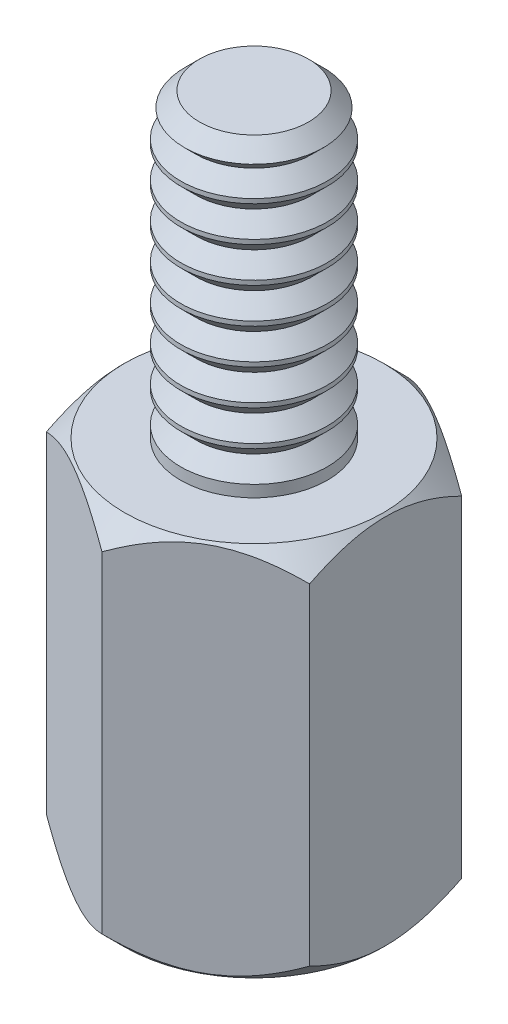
ISO-10303-21;
HEADER;
FILE_DESCRIPTION(('STEP AP214'),'2;1');
FILE_NAME('part.step','',(''),(''),'','','');
FILE_SCHEMA(('AUTOMOTIVE_DESIGN { 1 0 10303 214 1 1 1 1 }'));
ENDSEC;
DATA;
#1=APPLICATION_CONTEXT('core data for automotive mechanical design processes');
#2=APPLICATION_PROTOCOL_DEFINITION('international standard','automotive_design',2000,#1);
#3=PRODUCT_CONTEXT('',#1,'mechanical');
#4=PRODUCT('Part','Part','',(#3));
#5=PRODUCT_RELATED_PRODUCT_CATEGORY('part','',(#4));
#6=PRODUCT_DEFINITION_FORMATION('','',#4);
#7=PRODUCT_DEFINITION_CONTEXT('part definition',#1,'design');
#8=PRODUCT_DEFINITION('design','',#6,#7);
#9=PRODUCT_DEFINITION_SHAPE('','',#8);
#10=(LENGTH_UNIT() NAMED_UNIT(*) SI_UNIT(.MILLI.,.METRE.));
#11=(NAMED_UNIT(*) PLANE_ANGLE_UNIT() SI_UNIT($,.RADIAN.));
#12=(NAMED_UNIT(*) SI_UNIT($,.STERADIAN.) SOLID_ANGLE_UNIT());
#13=UNCERTAINTY_MEASURE_WITH_UNIT(LENGTH_MEASURE(1.E-05),#10,'distance_accuracy_value','');
#14=(GEOMETRIC_REPRESENTATION_CONTEXT(3) GLOBAL_UNCERTAINTY_ASSIGNED_CONTEXT((#13)) GLOBAL_UNIT_ASSIGNED_CONTEXT((#10,
#11,#12)) REPRESENTATION_CONTEXT('',''));
#15=CARTESIAN_POINT('',(0.,0.,0.));
#16=DIRECTION('',(0.,0.,1.));
#17=DIRECTION('',(1.,0.,0.));
#18=AXIS2_PLACEMENT_3D('',#15,#16,#17);
#19=CARTESIAN_POINT('',(0.,18.,0.));
#20=DIRECTION('',(0.,-1.,0.));
#21=DIRECTION('',(0.,0.,-1.));
#22=AXIS2_PLACEMENT_3D('',#19,#20,#21);
#23=CYLINDRICAL_SURFACE('',#22,1.95);
#24=CARTESIAN_POINT('',(0.,13.9502438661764,0.));
#25=DIRECTION('',(0.,-1.,0.));
#26=DIRECTION('',(0.,0.,-1.));
#27=AXIS2_PLACEMENT_3D('',#24,#25,#26);
#28=CIRCLE('',#27,1.95);
#29=CARTESIAN_POINT('',(0.,13.9502438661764,-1.95));
#30=VERTEX_POINT('',#29);
#31=EDGE_CURVE('E320',#30,#30,#28,.T.);
#32=ORIENTED_EDGE('',*,*,#31,.F.);
#33=EDGE_LOOP('',(#32));
#34=FACE_BOUND('',#33,.T.);
#35=CARTESIAN_POINT('',(0.,14.07,0.));
#36=DIRECTION('',(0.,-1.,0.));
#37=DIRECTION('',(0.,0.,-1.));
#38=AXIS2_PLACEMENT_3D('',#35,#36,#37);
#39=CIRCLE('',#38,1.95);
#40=CARTESIAN_POINT('',(0.,14.07,-1.95));
#41=VERTEX_POINT('',#40);
#42=EDGE_CURVE('E635',#41,#41,#39,.T.);
#43=ORIENTED_EDGE('',*,*,#42,.T.);
#44=EDGE_LOOP('',(#43));
#45=FACE_BOUND('',#44,.T.);
#46=ADVANCED_FACE('F34',(#34,#45),#23,.T.);
#47=CARTESIAN_POINT('',(0.,11.25,0.));
#48=DIRECTION('',(0.,-1.,0.));
#49=DIRECTION('',(0.,0.,-1.));
#50=AXIS2_PLACEMENT_3D('',#47,#48,#49);
#51=CIRCLE('',#50,1.95);
#52=CARTESIAN_POINT('',(0.,11.25,-1.95));
#53=VERTEX_POINT('',#52);
#54=EDGE_CURVE('E314',#53,#53,#51,.T.);
#55=ORIENTED_EDGE('',*,*,#54,.T.);
#56=EDGE_LOOP('',(#55));
#57=FACE_BOUND('',#56,.T.);
#58=CARTESIAN_POINT('',(0.,11.1302438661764,0.));
#59=DIRECTION('',(0.,-1.,0.));
#60=DIRECTION('',(0.,0.,-1.));
#61=AXIS2_PLACEMENT_3D('',#58,#59,#60);
#62=CIRCLE('',#61,1.95);
#63=CARTESIAN_POINT('',(0.,11.1302438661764,-1.95));
#64=VERTEX_POINT('',#63);
#65=EDGE_CURVE('E363',#64,#64,#62,.T.);
#66=ORIENTED_EDGE('',*,*,#65,.F.);
#67=EDGE_LOOP('',(#66));
#68=FACE_BOUND('',#67,.T.);
#69=ADVANCED_FACE('F240',(#57,#68),#23,.T.);
#70=CARTESIAN_POINT('',(0.,12.19,0.));
#71=DIRECTION('',(0.,-1.,0.));
#72=DIRECTION('',(0.,0.,-1.));
#73=AXIS2_PLACEMENT_3D('',#70,#71,#72);
#74=CIRCLE('',#73,1.95);
#75=CARTESIAN_POINT('',(0.,12.19,-1.95));
#76=VERTEX_POINT('',#75);
#77=EDGE_CURVE('E307',#76,#76,#74,.T.);
#78=ORIENTED_EDGE('',*,*,#77,.T.);
#79=EDGE_LOOP('',(#78));
#80=FACE_BOUND('',#79,.T.);
#81=CARTESIAN_POINT('',(0.,12.0702438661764,0.));
#82=DIRECTION('',(0.,-1.,0.));
#83=DIRECTION('',(0.,0.,-1.));
#84=AXIS2_PLACEMENT_3D('',#81,#82,#83);
#85=CIRCLE('',#84,1.95);
#86=CARTESIAN_POINT('',(0.,12.0702438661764,-1.95));
#87=VERTEX_POINT('',#86);
#88=EDGE_CURVE('E366',#87,#87,#85,.T.);
#89=ORIENTED_EDGE('',*,*,#88,.F.);
#90=EDGE_LOOP('',(#89));
#91=FACE_BOUND('',#90,.T.);
#92=ADVANCED_FACE('F239',(#80,#91),#23,.T.);
#93=CARTESIAN_POINT('',(0.,13.13,0.));
#94=DIRECTION('',(0.,-1.,0.));
#95=DIRECTION('',(0.,0.,-1.));
#96=AXIS2_PLACEMENT_3D('',#93,#94,#95);
#97=CIRCLE('',#96,1.95);
#98=CARTESIAN_POINT('',(0.,13.13,-1.95));
#99=VERTEX_POINT('',#98);
#100=EDGE_CURVE('E302',#99,#99,#97,.T.);
#101=ORIENTED_EDGE('',*,*,#100,.T.);
#102=EDGE_LOOP('',(#101));
#103=FACE_BOUND('',#102,.T.);
#104=CARTESIAN_POINT('',(0.,13.0102438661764,0.));
#105=DIRECTION('',(0.,-1.,0.));
#106=DIRECTION('',(0.,0.,-1.));
#107=AXIS2_PLACEMENT_3D('',#104,#105,#106);
#108=CIRCLE('',#107,1.95);
#109=CARTESIAN_POINT('',(0.,13.0102438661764,-1.95));
#110=VERTEX_POINT('',#109);
#111=EDGE_CURVE('E305',#110,#110,#108,.T.);
#112=ORIENTED_EDGE('',*,*,#111,.F.);
#113=EDGE_LOOP('',(#112));
#114=FACE_BOUND('',#113,.T.);
#115=ADVANCED_FACE('F277',(#103,#114),#23,.T.);
#116=CARTESIAN_POINT('',(0.,13.5401219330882,0.));
#117=DIRECTION('',(0.,1.,0.));
#118=DIRECTION('',(0.,0.,1.));
#119=AXIS2_PLACEMENT_3D('',#116,#117,#118);
#120=CONICAL_SURFACE('',#119,1.5398780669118,0.785398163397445);
#121=ORIENTED_EDGE('',*,*,#31,.T.);
#122=EDGE_LOOP('',(#121));
#123=FACE_BOUND('',#122,.T.);
#124=CARTESIAN_POINT('',(0.,13.5401219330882,0.));
#125=DIRECTION('',(0.,-1.,0.));
#126=DIRECTION('',(0.,0.,-1.));
#127=AXIS2_PLACEMENT_3D('',#124,#125,#126);
#128=CIRCLE('',#127,1.5398780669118);
#129=CARTESIAN_POINT('',(0.,13.5401219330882,-1.5398780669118));
#130=VERTEX_POINT('',#129);
#131=EDGE_CURVE('E324',#130,#130,#128,.T.);
#132=ORIENTED_EDGE('',*,*,#131,.F.);
#133=EDGE_LOOP('',(#132));
#134=FACE_BOUND('',#133,.T.);
#135=ADVANCED_FACE('F289',(#123,#134),#120,.T.);
#136=CARTESIAN_POINT('',(0.,13.13,0.));
#137=DIRECTION('',(0.,-1.,0.));
#138=DIRECTION('',(0.,0.,-1.));
#139=AXIS2_PLACEMENT_3D('',#136,#137,#138);
#140=CONICAL_SURFACE('',#139,1.95,0.785398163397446);
#141=ORIENTED_EDGE('',*,*,#131,.T.);
#142=EDGE_LOOP('',(#141));
#143=FACE_BOUND('',#142,.T.);
#144=ORIENTED_EDGE('',*,*,#100,.F.);
#145=EDGE_LOOP('',(#144));
#146=FACE_BOUND('',#145,.T.);
#147=ADVANCED_FACE('F295',(#143,#146),#140,.T.);
#148=CARTESIAN_POINT('',(0.,12.6001219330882,0.));
#149=DIRECTION('',(0.,1.,0.));
#150=DIRECTION('',(0.,0.,1.));
#151=AXIS2_PLACEMENT_3D('',#148,#149,#150);
#152=CONICAL_SURFACE('',#151,1.5398780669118,0.785398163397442);
#153=ORIENTED_EDGE('',*,*,#111,.T.);
#154=EDGE_LOOP('',(#153));
#155=FACE_BOUND('',#154,.T.);
#156=CARTESIAN_POINT('',(0.,12.6001219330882,0.));
#157=DIRECTION('',(0.,-1.,0.));
#158=DIRECTION('',(0.,0.,-1.));
#159=AXIS2_PLACEMENT_3D('',#156,#157,#158);
#160=CIRCLE('',#159,1.5398780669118);
#161=CARTESIAN_POINT('',(0.,12.6001219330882,-1.5398780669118));
#162=VERTEX_POINT('',#161);
#163=EDGE_CURVE('E311',#162,#162,#160,.T.);
#164=ORIENTED_EDGE('',*,*,#163,.F.);
#165=EDGE_LOOP('',(#164));
#166=FACE_BOUND('',#165,.T.);
#167=ADVANCED_FACE('F395',(#155,#166),#152,.T.);
#168=CARTESIAN_POINT('',(0.,12.19,0.));
#169=DIRECTION('',(0.,-1.,0.));
#170=DIRECTION('',(0.,0.,-1.));
#171=AXIS2_PLACEMENT_3D('',#168,#169,#170);
#172=CONICAL_SURFACE('',#171,1.95,0.785398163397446);
#173=ORIENTED_EDGE('',*,*,#163,.T.);
#174=EDGE_LOOP('',(#173));
#175=FACE_BOUND('',#174,.T.);
#176=ORIENTED_EDGE('',*,*,#77,.F.);
#177=EDGE_LOOP('',(#176));
#178=FACE_BOUND('',#177,.T.);
#179=ADVANCED_FACE('F390',(#175,#178),#172,.T.);
#180=CARTESIAN_POINT('',(0.,11.6601219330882,0.));
#181=DIRECTION('',(0.,1.,0.));
#182=DIRECTION('',(0.,0.,1.));
#183=AXIS2_PLACEMENT_3D('',#180,#181,#182);
#184=CONICAL_SURFACE('',#183,1.5398780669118,0.785398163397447);
#185=ORIENTED_EDGE('',*,*,#88,.T.);
#186=EDGE_LOOP('',(#185));
#187=FACE_BOUND('',#186,.T.);
#188=CARTESIAN_POINT('',(0.,11.6601219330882,0.));
#189=DIRECTION('',(0.,-1.,0.));
#190=DIRECTION('',(0.,0.,-1.));
#191=AXIS2_PLACEMENT_3D('',#188,#189,#190);
#192=CIRCLE('',#191,1.5398780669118);
#193=CARTESIAN_POINT('',(0.,11.6601219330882,-1.5398780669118));
#194=VERTEX_POINT('',#193);
#195=EDGE_CURVE('E308',#194,#194,#192,.T.);
#196=ORIENTED_EDGE('',*,*,#195,.F.);
#197=EDGE_LOOP('',(#196));
#198=FACE_BOUND('',#197,.T.);
#199=ADVANCED_FACE('F381',(#187,#198),#184,.T.);
#200=CARTESIAN_POINT('',(0.,11.25,0.));
#201=DIRECTION('',(0.,-1.,0.));
#202=DIRECTION('',(0.,0.,-1.));
#203=AXIS2_PLACEMENT_3D('',#200,#201,#202);
#204=CONICAL_SURFACE('',#203,1.95,0.785398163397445);
#205=ORIENTED_EDGE('',*,*,#195,.T.);
#206=EDGE_LOOP('',(#205));
#207=FACE_BOUND('',#206,.T.);
#208=ORIENTED_EDGE('',*,*,#54,.F.);
#209=EDGE_LOOP('',(#208));
#210=FACE_BOUND('',#209,.T.);
#211=ADVANCED_FACE('F378',(#207,#210),#204,.T.);
#212=CARTESIAN_POINT('',(0.,10.7201219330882,0.));
#213=DIRECTION('',(0.,1.,0.));
#214=DIRECTION('',(0.,0.,1.));
#215=AXIS2_PLACEMENT_3D('',#212,#213,#214);
#216=CONICAL_SURFACE('',#215,1.5398780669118,0.785398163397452);
#217=ORIENTED_EDGE('',*,*,#65,.T.);
#218=EDGE_LOOP('',(#217));
#219=FACE_BOUND('',#218,.T.);
#220=CARTESIAN_POINT('',(0.,10.7201219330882,0.));
#221=DIRECTION('',(0.,-1.,0.));
#222=DIRECTION('',(0.,0.,-1.));
#223=AXIS2_PLACEMENT_3D('',#220,#221,#222);
#224=CIRCLE('',#223,1.5398780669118);
#225=CARTESIAN_POINT('',(0.,10.7201219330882,-1.5398780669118));
#226=VERTEX_POINT('',#225);
#227=EDGE_CURVE('E362',#226,#226,#224,.T.);
#228=ORIENTED_EDGE('',*,*,#227,.F.);
#229=EDGE_LOOP('',(#228));
#230=FACE_BOUND('',#229,.T.);
#231=ADVANCED_FACE('F380',(#219,#230),#216,.T.);
#232=CARTESIAN_POINT('',(0.,10.31,0.));
#233=DIRECTION('',(0.,-1.,0.));
#234=DIRECTION('',(0.,0.,-1.));
#235=AXIS2_PLACEMENT_3D('',#232,#233,#234);
#236=CONICAL_SURFACE('',#235,1.95,0.785398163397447);
#237=ORIENTED_EDGE('',*,*,#227,.T.);
#238=EDGE_LOOP('',(#237));
#239=FACE_BOUND('',#238,.T.);
#240=CARTESIAN_POINT('',(0.,10.31,0.));
#241=DIRECTION('',(0.,-1.,0.));
#242=DIRECTION('',(0.,0.,-1.));
#243=AXIS2_PLACEMENT_3D('',#240,#241,#242);
#244=CIRCLE('',#243,1.95);
#245=CARTESIAN_POINT('',(0.,10.31,-1.95));
#246=VERTEX_POINT('',#245);
#247=EDGE_CURVE('E360',#246,#246,#244,.T.);
#248=ORIENTED_EDGE('',*,*,#247,.F.);
#249=EDGE_LOOP('',(#248));
#250=FACE_BOUND('',#249,.T.);
#251=ADVANCED_FACE('F227',(#239,#250),#236,.T.);
#252=CARTESIAN_POINT('',(0.,0.,0.));
#253=DIRECTION('',(0.,1.,0.));
#254=DIRECTION('',(0.,0.,1.));
#255=AXIS2_PLACEMENT_3D('',#252,#253,#254);
#256=PLANE('',#255);
#257=CARTESIAN_POINT('',(0.,0.,0.));
#258=DIRECTION('',(0.,-1.,0.));
#259=DIRECTION('',(0.,0.,-1.));
#260=AXIS2_PLACEMENT_3D('',#257,#258,#259);
#261=CIRCLE('',#260,1.95);
#262=CARTESIAN_POINT('',(0.,0.,-1.95));
#263=VERTEX_POINT('',#262);
#264=EDGE_CURVE('E636',#263,#263,#261,.T.);
#265=ORIENTED_EDGE('',*,*,#264,.F.);
#266=EDGE_LOOP('',(#265));
#267=FACE_BOUND('',#266,.T.);
#268=CARTESIAN_POINT('',(0.,0.,0.));
#269=DIRECTION('',(0.,1.,0.));
#270=DIRECTION('',(0.,0.,1.));
#271=AXIS2_PLACEMENT_3D('',#268,#269,#270);
#272=CIRCLE('',#271,3.44145188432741);
#273=CARTESIAN_POINT('',(0.,0.,3.44145188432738));
#274=VERTEX_POINT('',#273);
#275=EDGE_CURVE('E353',#274,#274,#272,.T.);
#276=ORIENTED_EDGE('',*,*,#275,.F.);
#277=EDGE_LOOP('',(#276));
#278=FACE_BOUND('',#277,.T.);
#279=ADVANCED_FACE('F154',(#267,#278),#256,.F.);
#280=CARTESIAN_POINT('',(0.,0.,0.));
#281=DIRECTION('',(0.,1.,0.));
#282=DIRECTION('',(0.,0.,1.));
#283=AXIS2_PLACEMENT_3D('',#280,#281,#282);
#284=CONICAL_SURFACE('',#283,3.44145188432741,0.785398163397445);
#285=ORIENTED_EDGE('',*,*,#275,.T.);
#286=EDGE_LOOP('',(#285));
#287=FACE_BOUND('',#286,.T.);
#288=CARTESIAN_POINT('',(3.5,2.02072419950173,-4.19349109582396));
#289=CARTESIAN_POINT('',(3.5,1.94289024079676,-4.09208669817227));
#290=CARTESIAN_POINT('',(3.5,1.86576032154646,-3.99013324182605));
#291=CARTESIAN_POINT('',(3.5,1.71322942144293,-3.78490475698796));
#292=CARTESIAN_POINT('',(3.5,1.63782885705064,-3.68162941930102));
#293=CARTESIAN_POINT('',(3.5,1.48854088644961,-3.47277876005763));
#294=CARTESIAN_POINT('',(3.5,1.41466965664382,-3.36719183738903));
#295=CARTESIAN_POINT('',(3.5,1.26952037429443,-3.15425614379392));
#296=CARTESIAN_POINT('',(3.5,1.19824214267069,-3.04690749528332));
#297=CARTESIAN_POINT('',(3.5,1.05450441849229,-2.8233680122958));
#298=CARTESIAN_POINT('',(3.5,0.982250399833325,-2.7070443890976));
#299=CARTESIAN_POINT('',(3.5,0.84225947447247,-2.4716670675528));
#300=CARTESIAN_POINT('',(3.5,0.774523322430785,-2.35261291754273));
#301=CARTESIAN_POINT('',(3.5,0.64501308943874,-2.11174739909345));
#302=CARTESIAN_POINT('',(3.5,0.583221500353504,-1.98994551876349));
#303=CARTESIAN_POINT('',(3.5,0.466984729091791,-1.74291320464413));
#304=CARTESIAN_POINT('',(3.5,0.412536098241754,-1.61768441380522));
#305=CARTESIAN_POINT('',(3.5,0.317760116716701,-1.37579906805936));
#306=CARTESIAN_POINT('',(3.5,0.276577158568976,-1.25948120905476));
#307=CARTESIAN_POINT('',(3.5,0.203523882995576,-1.02390221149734));
#308=CARTESIAN_POINT('',(3.5,0.171654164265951,-0.904640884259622));
#309=CARTESIAN_POINT('',(3.5,0.11947561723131,-0.665952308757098));
#310=CARTESIAN_POINT('',(3.5,0.0989583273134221,-0.546571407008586));
#311=CARTESIAN_POINT('',(3.5,0.0699092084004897,-0.306352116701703));
#312=CARTESIAN_POINT('',(3.5,0.0613749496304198,-0.185514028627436));
#313=CARTESIAN_POINT('',(3.5,0.0570073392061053,0.0512281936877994));
#314=CARTESIAN_POINT('',(3.5,0.0606472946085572,0.167122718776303));
#315=CARTESIAN_POINT('',(3.5,0.0792233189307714,0.397996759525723));
#316=CARTESIAN_POINT('',(3.5,0.0941604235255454,0.512976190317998));
#317=CARTESIAN_POINT('',(3.5,0.134743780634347,0.743135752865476));
#318=CARTESIAN_POINT('',(3.5,0.16057823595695,0.858282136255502));
#319=CARTESIAN_POINT('',(3.5,0.22153002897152,1.08604290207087));
#320=CARTESIAN_POINT('',(3.5,0.256646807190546,1.19865743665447));
#321=CARTESIAN_POINT('',(3.5,0.33704334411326,1.4280323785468));
#322=CARTESIAN_POINT('',(3.5,0.382817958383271,1.54461737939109));
#323=CARTESIAN_POINT('',(3.5,0.481428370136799,1.77477031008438));
#324=CARTESIAN_POINT('',(3.5,0.534266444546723,1.88833725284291));
#325=CARTESIAN_POINT('',(3.5,0.645758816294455,2.11301559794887));
#326=CARTESIAN_POINT('',(3.5,0.704431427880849,2.22411783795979));
#327=CARTESIAN_POINT('',(3.5,0.826298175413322,2.44377531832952));
#328=CARTESIAN_POINT('',(3.5,0.889491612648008,2.55233094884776));
#329=CARTESIAN_POINT('',(3.5,1.01630412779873,2.76191944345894));
#330=CARTESIAN_POINT('',(3.5,1.07974785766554,2.86305896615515));
#331=CARTESIAN_POINT('',(3.5,1.20933246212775,3.06360047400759));
#332=CARTESIAN_POINT('',(3.5,1.27547353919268,3.16300232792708));
#333=CARTESIAN_POINT('',(3.5,1.40943239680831,3.35949586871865));
#334=CARTESIAN_POINT('',(3.5,1.4772324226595,3.45659970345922));
#335=CARTESIAN_POINT('',(3.5,1.61464743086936,3.64947574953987));
#336=CARTESIAN_POINT('',(3.5,1.6842619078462,3.74524832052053));
#337=CARTESIAN_POINT('',(3.5,1.75461899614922,3.84046254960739));
#338=B_SPLINE_CURVE_WITH_KNOTS('',3,(#288,#289,#290,#291,#292,#293,#294,#295,#296,#297,#298,
#299,#300,#301,#302,#303,#304,#305,#306,#307,#308,#309,#310,#311,#312,#313,#314,#315,#316,#317,
#318,#319,#320,#321,#322,#323,#324,#325,#326,#327,#328,#329,#330,#331,#332,#333,#334,#335,#336,
#337),.UNSPECIFIED.,.F.,.F.,(4,2,2,2,2,2,2,2,2,2,2,2,2,2,2,2,2,2,2,2,2,2,2,2,4),(0.,
0.383502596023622,0.767096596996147,1.15365209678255,1.54018084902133,1.95091122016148,
2.36171002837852,2.77125931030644,3.18061556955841,3.55047538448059,3.92035897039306,
4.28320370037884,4.64597484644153,4.99325794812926,5.34057289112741,5.69414898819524,
6.04770377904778,6.42316312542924,6.79874379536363,7.17554301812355,7.55228413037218,
7.91040820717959,8.26855921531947,8.62383088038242,8.97900462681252),.UNSPECIFIED.);
#339=CARTESIAN_POINT('',(3.5,0.600000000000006,2.02072594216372));
#340=VERTEX_POINT('',#339);
#341=CARTESIAN_POINT('',(3.5,0.599999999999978,-2.02072594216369));
#342=VERTEX_POINT('',#341);
#343=EDGE_CURVE('E91',#340,#342,#338,.F.);
#344=ORIENTED_EDGE('',*,*,#343,.F.);
#345=CARTESIAN_POINT('',(-0.000200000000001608,0.600115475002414,4.04156735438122));
#346=CARTESIAN_POINT('',(0.120108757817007,0.530715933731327,3.9721070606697));
#347=CARTESIAN_POINT('',(0.242429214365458,0.465392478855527,3.90148531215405));
#348=CARTESIAN_POINT('',(0.491853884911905,0.345787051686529,3.75747991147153));
#349=CARTESIAN_POINT('',(0.618981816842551,0.291571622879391,3.68408256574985));
#350=CARTESIAN_POINT('',(0.875329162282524,0.198699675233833,3.53608035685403));
#351=CARTESIAN_POINT('',(1.00448329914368,0.159809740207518,3.46151318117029));
#352=CARTESIAN_POINT('',(1.26563479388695,0.0998919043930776,3.31073729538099));
#353=CARTESIAN_POINT('',(1.39762417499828,0.0788192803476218,3.2345331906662));
#354=CARTESIAN_POINT('',(1.62510370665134,0.0598061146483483,3.10319782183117));
#355=CARTESIAN_POINT('',(1.72030010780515,0.0569916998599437,3.04823615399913));
#356=CARTESIAN_POINT('',(1.91053805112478,0.0617346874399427,2.93840222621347));
#357=CARTESIAN_POINT('',(2.00557952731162,0.0692957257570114,2.88353000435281));
#358=CARTESIAN_POINT('',(2.1947620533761,0.0943578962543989,2.77430542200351));
#359=CARTESIAN_POINT('',(2.28890197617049,0.111870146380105,2.71995371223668));
#360=CARTESIAN_POINT('',(2.47556499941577,0.155878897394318,2.61218376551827));
#361=CARTESIAN_POINT('',(2.56808822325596,0.182374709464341,2.55876545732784));
#362=CARTESIAN_POINT('',(2.73234167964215,0.236887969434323,2.46393368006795));
#363=CARTESIAN_POINT('',(2.80443551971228,0.263472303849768,2.42231028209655));
#364=CARTESIAN_POINT('',(2.94732893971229,0.320925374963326,2.33981072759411));
#365=CARTESIAN_POINT('',(3.01812848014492,0.351794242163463,2.29893459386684));
#366=CARTESIAN_POINT('',(3.15821024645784,0.417124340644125,2.21805834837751));
#367=CARTESIAN_POINT('',(3.22749645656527,0.451574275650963,2.17805593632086));
#368=CARTESIAN_POINT('',(3.36478573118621,0.523614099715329,2.09879193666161));
#369=CARTESIAN_POINT('',(3.43278955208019,0.561202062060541,2.05952991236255));
#370=CARTESIAN_POINT('',(3.5002,0.600115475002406,2.02061047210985));
#371=B_SPLINE_CURVE_WITH_KNOTS('',3,(#345,#346,#347,#348,#349,#350,#351,#352,#353,#354,#355,
#356,#357,#358,#359,#360,#361,#362,#363,#364,#365,#366,#367,#368,#369,#370),.UNSPECIFIED.,.F.,
.F.,(4,2,2,2,2,2,2,2,2,2,2,2,4),(0.,0.466195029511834,0.935106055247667,1.3965703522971,
1.85687285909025,2.18628459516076,2.51581179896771,2.845707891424,3.17557869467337,
3.43762138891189,3.69967206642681,3.96091985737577,4.22200840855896),.UNSPECIFIED.);
#372=CARTESIAN_POINT('',(0.,0.6,4.04145188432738));
#373=VERTEX_POINT('',#372);
#374=EDGE_CURVE('E86',#373,#340,#371,.T.);
#375=ORIENTED_EDGE('',*,*,#374,.F.);
#376=CARTESIAN_POINT('',(-3.5002,0.600115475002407,2.02061047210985));
#377=CARTESIAN_POINT('',(-3.37989124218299,0.530715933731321,2.09007076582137));
#378=CARTESIAN_POINT('',(-3.25757078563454,0.465392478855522,2.16069251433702));
#379=CARTESIAN_POINT('',(-3.0081461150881,0.345787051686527,2.30469791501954));
#380=CARTESIAN_POINT('',(-2.88101818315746,0.291571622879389,2.37809526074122));
#381=CARTESIAN_POINT('',(-2.62467083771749,0.198699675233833,2.52609746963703));
#382=CARTESIAN_POINT('',(-2.49551670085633,0.159809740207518,2.60066464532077));
#383=CARTESIAN_POINT('',(-2.23436520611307,0.0998919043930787,2.75144053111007));
#384=CARTESIAN_POINT('',(-2.10237582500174,0.078819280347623,2.82764463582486));
#385=CARTESIAN_POINT('',(-1.87489629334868,0.0598061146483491,2.95898000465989));
#386=CARTESIAN_POINT('',(-1.77969989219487,0.0569916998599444,3.01394167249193));
#387=CARTESIAN_POINT('',(-1.58946194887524,0.0617346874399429,3.12377560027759));
#388=CARTESIAN_POINT('',(-1.4944204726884,0.0692957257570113,3.17864782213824));
#389=CARTESIAN_POINT('',(-1.30523794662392,0.094357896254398,3.28787240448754));
#390=CARTESIAN_POINT('',(-1.21109802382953,0.111870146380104,3.34222411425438));
#391=CARTESIAN_POINT('',(-1.02443500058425,0.155878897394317,3.44999406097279));
#392=CARTESIAN_POINT('',(-0.931911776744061,0.182374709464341,3.50341236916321));
#393=CARTESIAN_POINT('',(-0.767658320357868,0.236887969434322,3.59824414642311));
#394=CARTESIAN_POINT('',(-0.695564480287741,0.263472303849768,3.63986754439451));
#395=CARTESIAN_POINT('',(-0.552671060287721,0.320925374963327,3.72236709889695));
#396=CARTESIAN_POINT('',(-0.481871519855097,0.351794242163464,3.76324323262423));
#397=CARTESIAN_POINT('',(-0.341789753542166,0.417124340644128,3.84411947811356));
#398=CARTESIAN_POINT('',(-0.272503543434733,0.451574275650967,3.88412189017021));
#399=CARTESIAN_POINT('',(-0.135214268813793,0.523614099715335,3.96338588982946));
#400=CARTESIAN_POINT('',(-0.0672104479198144,0.561202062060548,4.00264791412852));
#401=CARTESIAN_POINT('',(0.000199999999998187,0.600115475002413,4.04156735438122));
#402=B_SPLINE_CURVE_WITH_KNOTS('',3,(#376,#377,#378,#379,#380,#381,#382,#383,#384,#385,#386,
#387,#388,#389,#390,#391,#392,#393,#394,#395,#396,#397,#398,#399,#400,#401),.UNSPECIFIED.,.F.,
.F.,(4,2,2,2,2,2,2,2,2,2,2,2,4),(0.,0.466195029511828,0.935106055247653,1.39657035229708,
1.85687285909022,2.18628459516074,2.51581179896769,2.84570789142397,3.17557869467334,
3.43762138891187,3.69967206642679,3.96091985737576,4.22200840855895),.UNSPECIFIED.);
#403=CARTESIAN_POINT('',(-3.50000000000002,0.600000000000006,2.02072594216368));
#404=VERTEX_POINT('',#403);
#405=EDGE_CURVE('E89',#404,#373,#402,.T.);
#406=ORIENTED_EDGE('',*,*,#405,.F.);
#407=CARTESIAN_POINT('',(-3.5,2.02072419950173,-4.19349109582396));
#408=CARTESIAN_POINT('',(-3.5,1.94289024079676,-4.09208669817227));
#409=CARTESIAN_POINT('',(-3.5,1.86576032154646,-3.99013324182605));
#410=CARTESIAN_POINT('',(-3.5,1.71322942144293,-3.78490475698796));
#411=CARTESIAN_POINT('',(-3.5,1.63782885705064,-3.68162941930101));
#412=CARTESIAN_POINT('',(-3.5,1.48854088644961,-3.47277876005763));
#413=CARTESIAN_POINT('',(-3.5,1.41466965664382,-3.36719183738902));
#414=CARTESIAN_POINT('',(-3.5,1.26952037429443,-3.15425614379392));
#415=CARTESIAN_POINT('',(-3.5,1.1982421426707,-3.04690749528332));
#416=CARTESIAN_POINT('',(-3.5,1.0545044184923,-2.8233680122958));
#417=CARTESIAN_POINT('',(-3.5,0.982250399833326,-2.7070443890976));
#418=CARTESIAN_POINT('',(-3.5,0.842259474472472,-2.4716670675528));
#419=CARTESIAN_POINT('',(-3.5,0.774523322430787,-2.35261291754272));
#420=CARTESIAN_POINT('',(-3.5,0.645013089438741,-2.11174739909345));
#421=CARTESIAN_POINT('',(-3.5,0.583221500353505,-1.98994551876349));
#422=CARTESIAN_POINT('',(-3.5,0.466984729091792,-1.74291320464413));
#423=CARTESIAN_POINT('',(-3.5,0.412536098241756,-1.61768441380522));
#424=CARTESIAN_POINT('',(-3.5,0.317760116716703,-1.37579906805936));
#425=CARTESIAN_POINT('',(-3.5,0.276577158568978,-1.25948120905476));
#426=CARTESIAN_POINT('',(-3.5,0.203523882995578,-1.02390221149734));
#427=CARTESIAN_POINT('',(-3.5,0.171654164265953,-0.904640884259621));
#428=CARTESIAN_POINT('',(-3.5,0.119475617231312,-0.665952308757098));
#429=CARTESIAN_POINT('',(-3.5,0.0989583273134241,-0.546571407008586));
#430=CARTESIAN_POINT('',(-3.5,0.0699092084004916,-0.306352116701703));
#431=CARTESIAN_POINT('',(-3.5,0.0613749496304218,-0.185514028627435));
#432=CARTESIAN_POINT('',(-3.5,0.0570073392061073,0.0512281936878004));
#433=CARTESIAN_POINT('',(-3.5,0.0606472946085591,0.167122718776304));
#434=CARTESIAN_POINT('',(-3.5,0.0792233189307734,0.397996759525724));
#435=CARTESIAN_POINT('',(-3.5,0.0941604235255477,0.512976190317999));
#436=CARTESIAN_POINT('',(-3.5,0.134743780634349,0.743135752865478));
#437=CARTESIAN_POINT('',(-3.5,0.160578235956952,0.858282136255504));
#438=CARTESIAN_POINT('',(-3.5,0.221530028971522,1.08604290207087));
#439=CARTESIAN_POINT('',(-3.5,0.256646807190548,1.19865743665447));
#440=CARTESIAN_POINT('',(-3.5,0.337043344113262,1.4280323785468));
#441=CARTESIAN_POINT('',(-3.5,0.382817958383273,1.5446173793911));
#442=CARTESIAN_POINT('',(-3.5,0.481428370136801,1.77477031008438));
#443=CARTESIAN_POINT('',(-3.5,0.534266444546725,1.88833725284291));
#444=CARTESIAN_POINT('',(-3.5,0.645758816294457,2.11301559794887));
#445=CARTESIAN_POINT('',(-3.5,0.704431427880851,2.22411783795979));
#446=CARTESIAN_POINT('',(-3.5,0.826298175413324,2.44377531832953));
#447=CARTESIAN_POINT('',(-3.5,0.889491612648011,2.55233094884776));
#448=CARTESIAN_POINT('',(-3.5,1.01630412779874,2.76191944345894));
#449=CARTESIAN_POINT('',(-3.5,1.07974785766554,2.86305896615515));
#450=CARTESIAN_POINT('',(-3.5,1.20933246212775,3.06360047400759));
#451=CARTESIAN_POINT('',(-3.5,1.27547353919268,3.16300232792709));
#452=CARTESIAN_POINT('',(-3.5,1.40943239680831,3.35949586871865));
#453=CARTESIAN_POINT('',(-3.5,1.47723242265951,3.45659970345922));
#454=CARTESIAN_POINT('',(-3.5,1.61464743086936,3.64947574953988));
#455=CARTESIAN_POINT('',(-3.5,1.6842619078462,3.74524832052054));
#456=CARTESIAN_POINT('',(-3.5,1.75461899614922,3.84046254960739));
#457=B_SPLINE_CURVE_WITH_KNOTS('',3,(#407,#408,#409,#410,#411,#412,#413,#414,#415,#416,#417,
#418,#419,#420,#421,#422,#423,#424,#425,#426,#427,#428,#429,#430,#431,#432,#433,#434,#435,#436,
#437,#438,#439,#440,#441,#442,#443,#444,#445,#446,#447,#448,#449,#450,#451,#452,#453,#454,#455,
#456),.UNSPECIFIED.,.F.,.F.,(4,2,2,2,2,2,2,2,2,2,2,2,2,2,2,2,2,2,2,2,2,2,2,2,4),(0.,
0.383502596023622,0.767096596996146,1.15365209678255,1.54018084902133,1.95091122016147,
2.36171002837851,2.77125931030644,3.18061556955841,3.55047538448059,3.92035897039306,
4.28320370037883,4.64597484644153,4.99325794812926,5.3405728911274,5.69414898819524,
6.04770377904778,6.42316312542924,6.79874379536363,7.17554301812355,7.55228413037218,
7.91040820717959,8.26855921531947,8.62383088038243,8.97900462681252),.UNSPECIFIED.);
#458=CARTESIAN_POINT('',(-3.5,0.600000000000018,-2.02072594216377));
#459=VERTEX_POINT('',#458);
#460=EDGE_CURVE('E105',#459,#404,#457,.T.);
#461=ORIENTED_EDGE('',*,*,#460,.F.);
#462=CARTESIAN_POINT('',(0.000200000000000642,0.600115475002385,-4.04156735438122));
#463=CARTESIAN_POINT('',(-0.120108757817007,0.530715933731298,-3.9721070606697));
#464=CARTESIAN_POINT('',(-0.242429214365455,0.465392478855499,-3.90148531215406));
#465=CARTESIAN_POINT('',(-0.491853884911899,0.345787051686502,-3.75747991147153));
#466=CARTESIAN_POINT('',(-0.618981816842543,0.291571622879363,-3.68408256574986));
#467=CARTESIAN_POINT('',(-0.875329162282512,0.198699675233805,-3.53608035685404));
#468=CARTESIAN_POINT('',(-1.00448329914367,0.15980974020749,-3.4615131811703));
#469=CARTESIAN_POINT('',(-1.26563479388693,0.0998919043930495,-3.31073729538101));
#470=CARTESIAN_POINT('',(-1.39762417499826,0.078819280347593,-3.23453319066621));
#471=CARTESIAN_POINT('',(-1.62510370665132,0.0598061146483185,-3.10319782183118));
#472=CARTESIAN_POINT('',(-1.72030010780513,0.0569916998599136,-3.04823615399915));
#473=CARTESIAN_POINT('',(-1.91053805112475,0.0617346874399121,-2.93840222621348));
#474=CARTESIAN_POINT('',(-2.00557952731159,0.0692957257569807,-2.88353000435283));
#475=CARTESIAN_POINT('',(-2.19476205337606,0.0943578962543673,-2.77430542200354));
#476=CARTESIAN_POINT('',(-2.28890197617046,0.111870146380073,-2.7199537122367));
#477=CARTESIAN_POINT('',(-2.47556499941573,0.155878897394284,-2.6121837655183));
#478=CARTESIAN_POINT('',(-2.56808822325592,0.182374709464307,-2.55876545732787));
#479=CARTESIAN_POINT('',(-2.73234167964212,0.236887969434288,-2.46393368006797));
#480=CARTESIAN_POINT('',(-2.80443551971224,0.263472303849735,-2.42231028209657));
#481=CARTESIAN_POINT('',(-2.94732893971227,0.320925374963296,-2.33981072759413));
#482=CARTESIAN_POINT('',(-3.01812848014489,0.351794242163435,-2.29893459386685));
#483=CARTESIAN_POINT('',(-3.15821024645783,0.417124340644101,-2.21805834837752));
#484=CARTESIAN_POINT('',(-3.22749645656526,0.451574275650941,-2.17805593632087));
#485=CARTESIAN_POINT('',(-3.36478573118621,0.523614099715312,-2.09879193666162));
#486=CARTESIAN_POINT('',(-3.43278955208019,0.561202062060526,-2.05952991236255));
#487=CARTESIAN_POINT('',(-3.5002,0.600115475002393,-2.02061047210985));
#488=B_SPLINE_CURVE_WITH_KNOTS('',3,(#462,#463,#464,#465,#466,#467,#468,#469,#470,#471,#472,
#473,#474,#475,#476,#477,#478,#479,#480,#481,#482,#483,#484,#485,#486,#487),.UNSPECIFIED.,.F.,
.F.,(4,2,2,2,2,2,2,2,2,2,2,2,4),(0.,0.466195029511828,0.935106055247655,1.39657035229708,
1.85687285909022,2.18628459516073,2.51581179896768,2.84570789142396,3.17557869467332,
3.43762138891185,3.69967206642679,3.96091985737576,4.22200840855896),.UNSPECIFIED.);
#489=CARTESIAN_POINT('',(0.,0.600000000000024,-4.04145188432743));
#490=VERTEX_POINT('',#489);
#491=EDGE_CURVE('E125',#490,#459,#488,.T.);
#492=ORIENTED_EDGE('',*,*,#491,.F.);
#493=CARTESIAN_POINT('',(3.5002,0.600115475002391,-2.02061047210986));
#494=CARTESIAN_POINT('',(3.37989124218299,0.530715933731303,-2.09007076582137));
#495=CARTESIAN_POINT('',(3.25757078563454,0.465392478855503,-2.16069251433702));
#496=CARTESIAN_POINT('',(3.00814611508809,0.345787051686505,-2.30469791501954));
#497=CARTESIAN_POINT('',(2.88101818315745,0.291571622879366,-2.37809526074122));
#498=CARTESIAN_POINT('',(2.62467083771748,0.198699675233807,-2.52609746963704));
#499=CARTESIAN_POINT('',(2.49551670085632,0.159809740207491,-2.60066464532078));
#500=CARTESIAN_POINT('',(2.23436520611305,0.0998919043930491,-2.75144053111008));
#501=CARTESIAN_POINT('',(2.10237582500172,0.0788192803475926,-2.82764463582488));
#502=CARTESIAN_POINT('',(1.87489629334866,0.0598061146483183,-2.9589800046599));
#503=CARTESIAN_POINT('',(1.77969989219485,0.0569916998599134,-3.01394167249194));
#504=CARTESIAN_POINT('',(1.58946194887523,0.0617346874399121,-3.1237756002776));
#505=CARTESIAN_POINT('',(1.49442047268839,0.0692957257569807,-3.17864782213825));
#506=CARTESIAN_POINT('',(1.30523794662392,0.0943578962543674,-3.28787240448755));
#507=CARTESIAN_POINT('',(1.21109802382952,0.111870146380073,-3.34222411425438));
#508=CARTESIAN_POINT('',(1.02443500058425,0.155878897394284,-3.44999406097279));
#509=CARTESIAN_POINT('',(0.93191177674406,0.182374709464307,-3.50341236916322));
#510=CARTESIAN_POINT('',(0.767658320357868,0.236887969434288,-3.59824414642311));
#511=CARTESIAN_POINT('',(0.695564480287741,0.263472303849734,-3.63986754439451));
#512=CARTESIAN_POINT('',(0.552671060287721,0.320925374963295,-3.72236709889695));
#513=CARTESIAN_POINT('',(0.481871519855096,0.351794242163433,-3.76324323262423));
#514=CARTESIAN_POINT('',(0.341789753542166,0.417124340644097,-3.84411947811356));
#515=CARTESIAN_POINT('',(0.272503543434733,0.451574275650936,-3.88412189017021));
#516=CARTESIAN_POINT('',(0.135214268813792,0.523614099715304,-3.96338588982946));
#517=CARTESIAN_POINT('',(0.0672104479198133,0.561202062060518,-4.00264791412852));
#518=CARTESIAN_POINT('',(-0.000199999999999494,0.600115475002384,-4.04156735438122));
#519=B_SPLINE_CURVE_WITH_KNOTS('',3,(#493,#494,#495,#496,#497,#498,#499,#500,#501,#502,#503,
#504,#505,#506,#507,#508,#509,#510,#511,#512,#513,#514,#515,#516,#517,#518),.UNSPECIFIED.,.F.,
.F.,(4,2,2,2,2,2,2,2,2,2,2,2,4),(0.,0.466195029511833,0.935106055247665,1.3965703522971,
1.85687285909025,2.18628459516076,2.5158117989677,2.84570789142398,3.17557869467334,
3.43762138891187,3.6996720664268,3.96091985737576,4.22200840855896),.UNSPECIFIED.);
#520=EDGE_CURVE('E50',#342,#490,#519,.T.);
#521=ORIENTED_EDGE('',*,*,#520,.F.);
#522=EDGE_LOOP('',(#344,#375,#406,#461,#492,#521));
#523=FACE_BOUND('',#522,.T.);
#524=ADVANCED_FACE('F88',(#287,#523),#284,.T.);
#525=CARTESIAN_POINT('',(3.5,10.,-2.02072594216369));
#526=DIRECTION('',(-0.5,0.,0.866025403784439));
#527=DIRECTION('',(0.866025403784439,0.,0.5));
#528=AXIS2_PLACEMENT_3D('',#525,#526,#527);
#529=PLANE('',#528);
#530=DIRECTION('',(0.,-1.,0.));
#531=VECTOR('',#530,1.);
#532=CARTESIAN_POINT('',(3.5,10.,-2.02072594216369));
#533=LINE('',#532,#531);
#534=CARTESIAN_POINT('',(3.5,9.40000000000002,-2.0207259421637));
#535=VERTEX_POINT('',#534);
#536=EDGE_CURVE('E112',#535,#342,#533,.T.);
#537=ORIENTED_EDGE('',*,*,#536,.T.);
#538=ORIENTED_EDGE('',*,*,#520,.T.);
#539=DIRECTION('',(0.,-1.,0.));
#540=VECTOR('',#539,1.);
#541=CARTESIAN_POINT('',(0.,10.,-4.04145188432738));
#542=LINE('',#541,#540);
#543=CARTESIAN_POINT('',(0.,9.40000000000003,-4.04145188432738));
#544=VERTEX_POINT('',#543);
#545=EDGE_CURVE('E43',#544,#490,#542,.T.);
#546=ORIENTED_EDGE('',*,*,#545,.F.);
#547=CARTESIAN_POINT('',(-0.000199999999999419,9.39988452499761,-4.04156735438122));
#548=CARTESIAN_POINT('',(0.12010875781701,9.4692840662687,-3.9721070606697));
#549=CARTESIAN_POINT('',(0.242429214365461,9.5346075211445,-3.90148531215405));
#550=CARTESIAN_POINT('',(0.491853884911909,9.65421294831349,-3.75747991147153));
#551=CARTESIAN_POINT('',(0.618981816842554,9.70842837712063,-3.68408256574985));
#552=CARTESIAN_POINT('',(0.875329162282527,9.80130032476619,-3.53608035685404));
#553=CARTESIAN_POINT('',(1.00448329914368,9.8401902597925,-3.46151318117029));
#554=CARTESIAN_POINT('',(1.26563479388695,9.90010809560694,-3.31073729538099));
#555=CARTESIAN_POINT('',(1.39762417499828,9.92118071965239,-3.2345331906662));
#556=CARTESIAN_POINT('',(1.62510370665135,9.94019388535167,-3.10319782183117));
#557=CARTESIAN_POINT('',(1.72030010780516,9.94300830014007,-3.04823615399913));
#558=CARTESIAN_POINT('',(1.91053805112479,9.93826531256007,-2.93840222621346));
#559=CARTESIAN_POINT('',(2.00557952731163,9.930704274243,-2.88353000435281));
#560=CARTESIAN_POINT('',(2.19476205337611,9.90564210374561,-2.77430542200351));
#561=CARTESIAN_POINT('',(2.2889019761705,9.88812985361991,-2.71995371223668));
#562=CARTESIAN_POINT('',(2.47556499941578,9.84412110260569,-2.61218376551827));
#563=CARTESIAN_POINT('',(2.56808822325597,9.81762529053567,-2.55876545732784));
#564=CARTESIAN_POINT('',(2.73234167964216,9.76311203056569,-2.46393368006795));
#565=CARTESIAN_POINT('',(2.80443551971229,9.73652769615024,-2.42231028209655));
#566=CARTESIAN_POINT('',(2.9473289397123,9.67907462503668,-2.33981072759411));
#567=CARTESIAN_POINT('',(3.01812848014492,9.64820575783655,-2.29893459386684));
#568=CARTESIAN_POINT('',(3.15821024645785,9.58287565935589,-2.21805834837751));
#569=CARTESIAN_POINT('',(3.22749645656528,9.54842572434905,-2.17805593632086));
#570=CARTESIAN_POINT('',(3.36478573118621,9.47638590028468,-2.09879193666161));
#571=CARTESIAN_POINT('',(3.43278955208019,9.43879793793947,-2.05952991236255));
#572=CARTESIAN_POINT('',(3.5002,9.39988452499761,-2.02061047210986));
#573=B_SPLINE_CURVE_WITH_KNOTS('',3,(#547,#548,#549,#550,#551,#552,#553,#554,#555,#556,#557,
#558,#559,#560,#561,#562,#563,#564,#565,#566,#567,#568,#569,#570,#571,#572),.UNSPECIFIED.,.F.,
.F.,(4,2,2,2,2,2,2,2,2,2,2,2,4),(0.,0.466195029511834,0.935106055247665,1.3965703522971,
1.85687285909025,2.18628459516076,2.51581179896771,2.845707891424,3.17557869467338,
3.43762138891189,3.69967206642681,3.96091985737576,4.22200840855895),.UNSPECIFIED.);
#574=EDGE_CURVE('E131',#544,#535,#573,.T.);
#575=ORIENTED_EDGE('',*,*,#574,.T.);
#576=EDGE_LOOP('',(#537,#538,#546,#575));
#577=FACE_BOUND('',#576,.T.);
#578=ADVANCED_FACE('F130',(#577),#529,.F.);
#579=CARTESIAN_POINT('',(3.5,10.,2.02072594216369));
#580=DIRECTION('',(-1.,0.,0.));
#581=DIRECTION('',(0.,0.,1.));
#582=AXIS2_PLACEMENT_3D('',#579,#580,#581);
#583=PLANE('',#582);
#584=DIRECTION('',(0.,-1.,0.));
#585=VECTOR('',#584,1.);
#586=CARTESIAN_POINT('',(3.5,10.,2.02072594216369));
#587=LINE('',#586,#585);
#588=CARTESIAN_POINT('',(3.5,9.40000000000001,2.02072594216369));
#589=VERTEX_POINT('',#588);
#590=EDGE_CURVE('E108',#589,#340,#587,.T.);
#591=ORIENTED_EDGE('',*,*,#590,.T.);
#592=ORIENTED_EDGE('',*,*,#343,.T.);
#593=ORIENTED_EDGE('',*,*,#536,.F.);
#594=CARTESIAN_POINT('',(3.5,7.97927580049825,-4.19349109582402));
#595=CARTESIAN_POINT('',(3.5,8.05710975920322,-4.09208669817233));
#596=CARTESIAN_POINT('',(3.5,8.13423967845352,-3.99013324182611));
#597=CARTESIAN_POINT('',(3.5,8.28677057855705,-3.78490475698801));
#598=CARTESIAN_POINT('',(3.5,8.36217114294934,-3.68162941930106));
#599=CARTESIAN_POINT('',(3.5,8.51145911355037,-3.47277876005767));
#600=CARTESIAN_POINT('',(3.5,8.58533034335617,-3.36719183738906));
#601=CARTESIAN_POINT('',(3.5,8.73047962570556,-3.15425614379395));
#602=CARTESIAN_POINT('',(3.5,8.80175785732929,-3.04690749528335));
#603=CARTESIAN_POINT('',(3.5,8.9454955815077,-2.82336801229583));
#604=CARTESIAN_POINT('',(3.5,9.01774960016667,-2.70704438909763));
#605=CARTESIAN_POINT('',(3.5,9.15774052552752,-2.47166706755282));
#606=CARTESIAN_POINT('',(3.5,9.22547667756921,-2.35261291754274));
#607=CARTESIAN_POINT('',(3.5,9.35498691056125,-2.11174739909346));
#608=CARTESIAN_POINT('',(3.5,9.41677849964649,-1.9899455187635));
#609=CARTESIAN_POINT('',(3.5,9.5330152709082,-1.74291320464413));
#610=CARTESIAN_POINT('',(3.5,9.58746390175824,-1.61768441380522));
#611=CARTESIAN_POINT('',(3.5,9.68223988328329,-1.37579906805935));
#612=CARTESIAN_POINT('',(3.5,9.72342284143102,-1.25948120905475));
#613=CARTESIAN_POINT('',(3.5,9.79647611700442,-1.02390221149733));
#614=CARTESIAN_POINT('',(3.5,9.82834583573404,-0.904640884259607));
#615=CARTESIAN_POINT('',(3.5,9.88052438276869,-0.66595230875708));
#616=CARTESIAN_POINT('',(3.5,9.90104167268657,-0.546571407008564));
#617=CARTESIAN_POINT('',(3.5,9.93009079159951,-0.306352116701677));
#618=CARTESIAN_POINT('',(3.5,9.93862505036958,-0.185514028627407));
#619=CARTESIAN_POINT('',(3.5,9.94299266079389,0.0512281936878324));
#620=CARTESIAN_POINT('',(3.5,9.93935270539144,0.167122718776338));
#621=CARTESIAN_POINT('',(3.5,9.92077668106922,0.397996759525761));
#622=CARTESIAN_POINT('',(3.5,9.90583957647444,0.512976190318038));
#623=CARTESIAN_POINT('',(3.5,9.86525621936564,0.743135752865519));
#624=CARTESIAN_POINT('',(3.5,9.83942176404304,0.858282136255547));
#625=CARTESIAN_POINT('',(3.5,9.77846997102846,1.08604290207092));
#626=CARTESIAN_POINT('',(3.5,9.74335319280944,1.19865743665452));
#627=CARTESIAN_POINT('',(3.5,9.66295665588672,1.42803237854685));
#628=CARTESIAN_POINT('',(3.5,9.61718204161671,1.54461737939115));
#629=CARTESIAN_POINT('',(3.5,9.51857162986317,1.77477031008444));
#630=CARTESIAN_POINT('',(3.5,9.46573355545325,1.88833725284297));
#631=CARTESIAN_POINT('',(3.5,9.35424118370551,2.11301559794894));
#632=CARTESIAN_POINT('',(3.5,9.29556857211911,2.22411783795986));
#633=CARTESIAN_POINT('',(3.5,9.17370182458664,2.4437753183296));
#634=CARTESIAN_POINT('',(3.5,9.11050838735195,2.55233094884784));
#635=CARTESIAN_POINT('',(3.5,8.98369587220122,2.76191944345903));
#636=CARTESIAN_POINT('',(3.5,8.92025214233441,2.86305896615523));
#637=CARTESIAN_POINT('',(3.5,8.7906675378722,3.06360047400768));
#638=CARTESIAN_POINT('',(3.5,8.72452646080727,3.16300232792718));
#639=CARTESIAN_POINT('',(3.5,8.59056760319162,3.35949586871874));
#640=CARTESIAN_POINT('',(3.5,8.52276757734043,3.45659970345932));
#641=CARTESIAN_POINT('',(3.5,8.38535256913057,3.64947574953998));
#642=CARTESIAN_POINT('',(3.5,8.31573809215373,3.74524832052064));
#643=CARTESIAN_POINT('',(3.5,8.2453810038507,3.8404625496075));
#644=B_SPLINE_CURVE_WITH_KNOTS('',3,(#594,#595,#596,#597,#598,#599,#600,#601,#602,#603,#604,
#605,#606,#607,#608,#609,#610,#611,#612,#613,#614,#615,#616,#617,#618,#619,#620,#621,#622,#623,
#624,#625,#626,#627,#628,#629,#630,#631,#632,#633,#634,#635,#636,#637,#638,#639,#640,#641,#642,
#643),.UNSPECIFIED.,.F.,.F.,(4,2,2,2,2,2,2,2,2,2,2,2,2,2,2,2,2,2,2,2,2,2,2,2,4),(0.,
0.383502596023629,0.767096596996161,1.15365209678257,1.54018084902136,1.95091122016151,
2.36171002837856,2.77125931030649,3.18061556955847,3.55047538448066,3.92035897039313,
4.28320370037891,4.64597484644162,4.99325794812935,5.3405728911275,5.69414898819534,
6.04770377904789,6.42316312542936,6.79874379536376,7.17554301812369,7.55228413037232,
7.91040820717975,8.26855921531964,8.6238308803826,8.9790046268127),.UNSPECIFIED.);
#645=EDGE_CURVE('E136',#535,#589,#644,.T.);
#646=ORIENTED_EDGE('',*,*,#645,.T.);
#647=EDGE_LOOP('',(#591,#592,#593,#646));
#648=FACE_BOUND('',#647,.T.);
#649=ADVANCED_FACE('F219',(#648),#583,.F.);
#650=CARTESIAN_POINT('',(0.,10.,4.04145188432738));
#651=DIRECTION('',(-0.5,0.,-0.866025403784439));
#652=DIRECTION('',(-0.866025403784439,0.,0.5));
#653=AXIS2_PLACEMENT_3D('',#650,#651,#652);
#654=PLANE('',#653);
#655=DIRECTION('',(0.,-1.,0.));
#656=VECTOR('',#655,1.);
#657=CARTESIAN_POINT('',(0.,10.,4.04145188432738));
#658=LINE('',#657,#656);
#659=CARTESIAN_POINT('',(0.,9.4,4.04145188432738));
#660=VERTEX_POINT('',#659);
#661=EDGE_CURVE('E102',#660,#373,#658,.T.);
#662=ORIENTED_EDGE('',*,*,#661,.T.);
#663=ORIENTED_EDGE('',*,*,#374,.T.);
#664=ORIENTED_EDGE('',*,*,#590,.F.);
#665=CARTESIAN_POINT('',(3.5002,9.39988452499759,2.02061047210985));
#666=CARTESIAN_POINT('',(3.37989124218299,9.46928406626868,2.09007076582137));
#667=CARTESIAN_POINT('',(3.25757078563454,9.53460752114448,2.16069251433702));
#668=CARTESIAN_POINT('',(3.00814611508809,9.65421294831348,2.30469791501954));
#669=CARTESIAN_POINT('',(2.88101818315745,9.70842837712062,2.37809526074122));
#670=CARTESIAN_POINT('',(2.62467083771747,9.80130032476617,2.52609746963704));
#671=CARTESIAN_POINT('',(2.49551670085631,9.84019025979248,2.60066464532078));
#672=CARTESIAN_POINT('',(2.23436520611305,9.90010809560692,2.75144053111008));
#673=CARTESIAN_POINT('',(2.10237582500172,9.92118071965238,2.82764463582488));
#674=CARTESIAN_POINT('',(1.87489629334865,9.94019388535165,2.9589800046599));
#675=CARTESIAN_POINT('',(1.77969989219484,9.94300830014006,3.01394167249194));
#676=CARTESIAN_POINT('',(1.58946194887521,9.93826531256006,3.12377560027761));
#677=CARTESIAN_POINT('',(1.49442047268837,9.93070427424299,3.17864782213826));
#678=CARTESIAN_POINT('',(1.3052379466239,9.9056421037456,3.28787240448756));
#679=CARTESIAN_POINT('',(1.2110980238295,9.88812985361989,3.34222411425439));
#680=CARTESIAN_POINT('',(1.02443500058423,9.84412110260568,3.4499940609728));
#681=CARTESIAN_POINT('',(0.931911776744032,9.81762529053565,3.50341236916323));
#682=CARTESIAN_POINT('',(0.767658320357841,9.76311203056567,3.59824414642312));
#683=CARTESIAN_POINT('',(0.695564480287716,9.73652769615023,3.63986754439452));
#684=CARTESIAN_POINT('',(0.552671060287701,9.67907462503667,3.72236709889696));
#685=CARTESIAN_POINT('',(0.481871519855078,9.64820575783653,3.76324323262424));
#686=CARTESIAN_POINT('',(0.341789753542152,9.58287565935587,3.84411947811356));
#687=CARTESIAN_POINT('',(0.272503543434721,9.54842572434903,3.88412189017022));
#688=CARTESIAN_POINT('',(0.135214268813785,9.47638590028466,3.96338588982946));
#689=CARTESIAN_POINT('',(0.0672104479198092,9.43879793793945,4.00264791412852));
#690=CARTESIAN_POINT('',(-0.000200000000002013,9.39988452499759,4.04156735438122));
#691=B_SPLINE_CURVE_WITH_KNOTS('',3,(#665,#666,#667,#668,#669,#670,#671,#672,#673,#674,#675,
#676,#677,#678,#679,#680,#681,#682,#683,#684,#685,#686,#687,#688,#689,#690),.UNSPECIFIED.,.F.,
.F.,(4,2,2,2,2,2,2,2,2,2,2,2,4),(0.,0.466195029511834,0.935106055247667,1.3965703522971,
1.85687285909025,2.18628459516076,2.51581179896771,2.845707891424,3.17557869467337,
3.43762138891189,3.69967206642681,3.96091985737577,4.22200840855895),.UNSPECIFIED.);
#692=EDGE_CURVE('E58',#589,#660,#691,.T.);
#693=ORIENTED_EDGE('',*,*,#692,.T.);
#694=EDGE_LOOP('',(#662,#663,#664,#693));
#695=FACE_BOUND('',#694,.T.);
#696=ADVANCED_FACE('F107',(#695),#654,.F.);
#697=CARTESIAN_POINT('',(-3.5,10.,2.02072594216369));
#698=DIRECTION('',(0.5,0.,-0.866025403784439));
#699=DIRECTION('',(-0.866025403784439,0.,-0.5));
#700=AXIS2_PLACEMENT_3D('',#697,#698,#699);
#701=PLANE('',#700);
#702=DIRECTION('',(0.,-1.,0.));
#703=VECTOR('',#702,1.);
#704=CARTESIAN_POINT('',(-3.5,10.,2.02072594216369));
#705=LINE('',#704,#703);
#706=CARTESIAN_POINT('',(-3.5,9.40000000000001,2.02072594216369));
#707=VERTEX_POINT('',#706);
#708=EDGE_CURVE('E104',#707,#404,#705,.T.);
#709=ORIENTED_EDGE('',*,*,#708,.T.);
#710=ORIENTED_EDGE('',*,*,#405,.T.);
#711=ORIENTED_EDGE('',*,*,#661,.F.);
#712=CARTESIAN_POINT('',(0.000199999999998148,9.39988452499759,4.04156735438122));
#713=CARTESIAN_POINT('',(-0.120108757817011,9.46928406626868,3.9721070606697));
#714=CARTESIAN_POINT('',(-0.242429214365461,9.53460752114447,3.90148531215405));
#715=CARTESIAN_POINT('',(-0.491853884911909,9.65421294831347,3.75747991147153));
#716=CARTESIAN_POINT('',(-0.618981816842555,9.70842837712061,3.68408256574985));
#717=CARTESIAN_POINT('',(-0.875329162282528,9.80130032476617,3.53608035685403));
#718=CARTESIAN_POINT('',(-1.00448329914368,9.84019025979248,3.46151318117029));
#719=CARTESIAN_POINT('',(-1.26563479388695,9.90010809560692,3.31073729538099));
#720=CARTESIAN_POINT('',(-1.39762417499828,9.92118071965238,3.2345331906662));
#721=CARTESIAN_POINT('',(-1.62510370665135,9.94019388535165,3.10319782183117));
#722=CARTESIAN_POINT('',(-1.72030010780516,9.94300830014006,3.04823615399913));
#723=CARTESIAN_POINT('',(-1.91053805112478,9.93826531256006,2.93840222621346));
#724=CARTESIAN_POINT('',(-2.00557952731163,9.93070427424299,2.88353000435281));
#725=CARTESIAN_POINT('',(-2.1947620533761,9.9056421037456,2.77430542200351));
#726=CARTESIAN_POINT('',(-2.2889019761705,9.88812985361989,2.71995371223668));
#727=CARTESIAN_POINT('',(-2.47556499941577,9.84412110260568,2.61218376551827));
#728=CARTESIAN_POINT('',(-2.56808822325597,9.81762529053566,2.55876545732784));
#729=CARTESIAN_POINT('',(-2.73234167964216,9.76311203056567,2.46393368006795));
#730=CARTESIAN_POINT('',(-2.80443551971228,9.73652769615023,2.42231028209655));
#731=CARTESIAN_POINT('',(-2.9473289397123,9.67907462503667,2.33981072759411));
#732=CARTESIAN_POINT('',(-3.01812848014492,9.64820575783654,2.29893459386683));
#733=CARTESIAN_POINT('',(-3.15821024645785,9.58287565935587,2.21805834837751));
#734=CARTESIAN_POINT('',(-3.22749645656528,9.54842572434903,2.17805593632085));
#735=CARTESIAN_POINT('',(-3.36478573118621,9.47638590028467,2.09879193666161));
#736=CARTESIAN_POINT('',(-3.43278955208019,9.43879793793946,2.05952991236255));
#737=CARTESIAN_POINT('',(-3.5002,9.39988452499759,2.02061047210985));
#738=B_SPLINE_CURVE_WITH_KNOTS('',3,(#712,#713,#714,#715,#716,#717,#718,#719,#720,#721,#722,
#723,#724,#725,#726,#727,#728,#729,#730,#731,#732,#733,#734,#735,#736,#737),.UNSPECIFIED.,.F.,
.F.,(4,2,2,2,2,2,2,2,2,2,2,2,4),(0.,0.466195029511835,0.935106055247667,1.3965703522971,
1.85687285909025,2.18628459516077,2.51581179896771,2.845707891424,3.17557869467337,
3.43762138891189,3.69967206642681,3.96091985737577,4.22200840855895),.UNSPECIFIED.);
#739=EDGE_CURVE('E199',#660,#707,#738,.T.);
#740=ORIENTED_EDGE('',*,*,#739,.T.);
#741=EDGE_LOOP('',(#709,#710,#711,#740));
#742=FACE_BOUND('',#741,.T.);
#743=ADVANCED_FACE('F100',(#742),#701,.F.);
#744=CARTESIAN_POINT('',(-3.5,10.,-2.02072594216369));
#745=DIRECTION('',(1.,0.,0.));
#746=DIRECTION('',(0.,0.,-1.));
#747=AXIS2_PLACEMENT_3D('',#744,#745,#746);
#748=PLANE('',#747);
#749=DIRECTION('',(0.,-1.,0.));
#750=VECTOR('',#749,1.);
#751=CARTESIAN_POINT('',(-3.5,10.,-2.02072594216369));
#752=LINE('',#751,#750);
#753=CARTESIAN_POINT('',(-3.5,9.40000000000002,-2.02072594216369));
#754=VERTEX_POINT('',#753);
#755=EDGE_CURVE('E110',#754,#459,#752,.T.);
#756=ORIENTED_EDGE('',*,*,#755,.T.);
#757=ORIENTED_EDGE('',*,*,#460,.T.);
#758=ORIENTED_EDGE('',*,*,#708,.F.);
#759=CARTESIAN_POINT('',(-3.5,7.97927580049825,-4.19349109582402));
#760=CARTESIAN_POINT('',(-3.5,8.05710975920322,-4.09208669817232));
#761=CARTESIAN_POINT('',(-3.5,8.13423967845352,-3.99013324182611));
#762=CARTESIAN_POINT('',(-3.5,8.28677057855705,-3.784904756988));
#763=CARTESIAN_POINT('',(-3.5,8.36217114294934,-3.68162941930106));
#764=CARTESIAN_POINT('',(-3.5,8.51145911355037,-3.47277876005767));
#765=CARTESIAN_POINT('',(-3.5,8.58533034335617,-3.36719183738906));
#766=CARTESIAN_POINT('',(-3.5,8.73047962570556,-3.15425614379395));
#767=CARTESIAN_POINT('',(-3.5,8.80175785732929,-3.04690749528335));
#768=CARTESIAN_POINT('',(-3.5,8.94549558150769,-2.82336801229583));
#769=CARTESIAN_POINT('',(-3.5,9.01774960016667,-2.70704438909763));
#770=CARTESIAN_POINT('',(-3.5,9.15774052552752,-2.47166706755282));
#771=CARTESIAN_POINT('',(-3.5,9.22547667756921,-2.35261291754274));
#772=CARTESIAN_POINT('',(-3.5,9.35498691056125,-2.11174739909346));
#773=CARTESIAN_POINT('',(-3.5,9.41677849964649,-1.9899455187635));
#774=CARTESIAN_POINT('',(-3.5,9.5330152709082,-1.74291320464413));
#775=CARTESIAN_POINT('',(-3.5,9.58746390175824,-1.61768441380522));
#776=CARTESIAN_POINT('',(-3.5,9.68223988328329,-1.37579906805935));
#777=CARTESIAN_POINT('',(-3.5,9.72342284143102,-1.25948120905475));
#778=CARTESIAN_POINT('',(-3.5,9.79647611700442,-1.02390221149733));
#779=CARTESIAN_POINT('',(-3.5,9.82834583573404,-0.904640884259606));
#780=CARTESIAN_POINT('',(-3.5,9.88052438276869,-0.665952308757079));
#781=CARTESIAN_POINT('',(-3.5,9.90104167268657,-0.546571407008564));
#782=CARTESIAN_POINT('',(-3.5,9.9300907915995,-0.306352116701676));
#783=CARTESIAN_POINT('',(-3.5,9.93862505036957,-0.185514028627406));
#784=CARTESIAN_POINT('',(-3.5,9.94299266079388,0.0512281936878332));
#785=CARTESIAN_POINT('',(-3.5,9.93935270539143,0.167122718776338));
#786=CARTESIAN_POINT('',(-3.5,9.92077668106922,0.397996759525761));
#787=CARTESIAN_POINT('',(-3.5,9.90583957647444,0.512976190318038));
#788=CARTESIAN_POINT('',(-3.5,9.86525621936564,0.743135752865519));
#789=CARTESIAN_POINT('',(-3.5,9.83942176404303,0.858282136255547));
#790=CARTESIAN_POINT('',(-3.5,9.77846997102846,1.08604290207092));
#791=CARTESIAN_POINT('',(-3.5,9.74335319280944,1.19865743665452));
#792=CARTESIAN_POINT('',(-3.5,9.66295665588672,1.42803237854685));
#793=CARTESIAN_POINT('',(-3.5,9.6171820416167,1.54461737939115));
#794=CARTESIAN_POINT('',(-3.5,9.51857162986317,1.77477031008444));
#795=CARTESIAN_POINT('',(-3.5,9.46573355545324,1.88833725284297));
#796=CARTESIAN_POINT('',(-3.5,9.35424118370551,2.11301559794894));
#797=CARTESIAN_POINT('',(-3.5,9.29556857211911,2.22411783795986));
#798=CARTESIAN_POINT('',(-3.5,9.17370182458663,2.4437753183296));
#799=CARTESIAN_POINT('',(-3.5,9.11050838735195,2.55233094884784));
#800=CARTESIAN_POINT('',(-3.5,8.98369587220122,2.76191944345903));
#801=CARTESIAN_POINT('',(-3.5,8.92025214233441,2.86305896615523));
#802=CARTESIAN_POINT('',(-3.5,8.7906675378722,3.06360047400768));
#803=CARTESIAN_POINT('',(-3.5,8.72452646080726,3.16300232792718));
#804=CARTESIAN_POINT('',(-3.5,8.59056760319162,3.35949586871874));
#805=CARTESIAN_POINT('',(-3.5,8.52276757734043,3.45659970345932));
#806=CARTESIAN_POINT('',(-3.5,8.38535256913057,3.64947574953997));
#807=CARTESIAN_POINT('',(-3.5,8.31573809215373,3.74524832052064));
#808=CARTESIAN_POINT('',(-3.5,8.24538100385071,3.84046254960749));
#809=B_SPLINE_CURVE_WITH_KNOTS('',3,(#759,#760,#761,#762,#763,#764,#765,#766,#767,#768,#769,
#770,#771,#772,#773,#774,#775,#776,#777,#778,#779,#780,#781,#782,#783,#784,#785,#786,#787,#788,
#789,#790,#791,#792,#793,#794,#795,#796,#797,#798,#799,#800,#801,#802,#803,#804,#805,#806,#807,
#808),.UNSPECIFIED.,.F.,.F.,(4,2,2,2,2,2,2,2,2,2,2,2,2,2,2,2,2,2,2,2,2,2,2,2,4),(0.,
0.38350259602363,0.767096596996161,1.15365209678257,1.54018084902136,1.95091122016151,
2.36171002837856,2.77125931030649,3.18061556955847,3.55047538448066,3.92035897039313,
4.28320370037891,4.64597484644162,4.99325794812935,5.3405728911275,5.69414898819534,
6.04770377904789,6.42316312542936,6.79874379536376,7.17554301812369,7.55228413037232,
7.91040820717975,8.26855921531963,8.6238308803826,8.9790046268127),.UNSPECIFIED.);
#810=EDGE_CURVE('E192',#707,#754,#809,.F.);
#811=ORIENTED_EDGE('',*,*,#810,.T.);
#812=EDGE_LOOP('',(#756,#757,#758,#811));
#813=FACE_BOUND('',#812,.T.);
#814=ADVANCED_FACE('F184',(#813),#748,.F.);
#815=CARTESIAN_POINT('',(0.,10.,-4.04145188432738));
#816=DIRECTION('',(0.5,0.,0.866025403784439));
#817=DIRECTION('',(0.866025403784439,0.,-0.5));
#818=AXIS2_PLACEMENT_3D('',#815,#816,#817);
#819=PLANE('',#818);
#820=ORIENTED_EDGE('',*,*,#545,.T.);
#821=ORIENTED_EDGE('',*,*,#491,.T.);
#822=ORIENTED_EDGE('',*,*,#755,.F.);
#823=CARTESIAN_POINT('',(-3.5002,9.3998845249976,-2.02061047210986));
#824=CARTESIAN_POINT('',(-3.37989124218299,9.46928406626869,-2.09007076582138));
#825=CARTESIAN_POINT('',(-3.25757078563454,9.53460752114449,-2.16069251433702));
#826=CARTESIAN_POINT('',(-3.00814611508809,9.65421294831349,-2.30469791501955));
#827=CARTESIAN_POINT('',(-2.88101818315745,9.70842837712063,-2.37809526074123));
#828=CARTESIAN_POINT('',(-2.62467083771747,9.80130032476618,-2.52609746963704));
#829=CARTESIAN_POINT('',(-2.49551670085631,9.8401902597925,-2.60066464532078));
#830=CARTESIAN_POINT('',(-2.23436520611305,9.90010809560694,-2.75144053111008));
#831=CARTESIAN_POINT('',(-2.10237582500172,9.92118071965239,-2.82764463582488));
#832=CARTESIAN_POINT('',(-1.87489629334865,9.94019388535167,-2.95898000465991));
#833=CARTESIAN_POINT('',(-1.77969989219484,9.94300830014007,-3.01394167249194));
#834=CARTESIAN_POINT('',(-1.58946194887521,9.93826531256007,-3.12377560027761));
#835=CARTESIAN_POINT('',(-1.49442047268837,9.930704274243,-3.17864782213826));
#836=CARTESIAN_POINT('',(-1.30523794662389,9.90564210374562,-3.28787240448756));
#837=CARTESIAN_POINT('',(-1.21109802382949,9.88812985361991,-3.3422241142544));
#838=CARTESIAN_POINT('',(-1.02443500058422,9.84412110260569,-3.44999406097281));
#839=CARTESIAN_POINT('',(-0.931911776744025,9.81762529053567,-3.50341236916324));
#840=CARTESIAN_POINT('',(-0.767658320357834,9.76311203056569,-3.59824414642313));
#841=CARTESIAN_POINT('',(-0.695564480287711,9.73652769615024,-3.63986754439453));
#842=CARTESIAN_POINT('',(-0.552671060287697,9.67907462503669,-3.72236709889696));
#843=CARTESIAN_POINT('',(-0.481871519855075,9.64820575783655,-3.76324323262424));
#844=CARTESIAN_POINT('',(-0.34178975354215,9.58287565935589,-3.84411947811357));
#845=CARTESIAN_POINT('',(-0.27250354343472,9.54842572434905,-3.88412189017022));
#846=CARTESIAN_POINT('',(-0.135214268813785,9.47638590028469,-3.96338588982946));
#847=CARTESIAN_POINT('',(-0.0672104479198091,9.43879793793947,-4.00264791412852));
#848=CARTESIAN_POINT('',(0.000200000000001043,9.39988452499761,-4.04156735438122));
#849=B_SPLINE_CURVE_WITH_KNOTS('',3,(#823,#824,#825,#826,#827,#828,#829,#830,#831,#832,#833,
#834,#835,#836,#837,#838,#839,#840,#841,#842,#843,#844,#845,#846,#847,#848),.UNSPECIFIED.,.F.,
.F.,(4,2,2,2,2,2,2,2,2,2,2,2,4),(0.,0.466195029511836,0.93510605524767,1.3965703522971,
1.85687285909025,2.18628459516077,2.51581179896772,2.84570789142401,3.17557869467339,
3.4376213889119,3.69967206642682,3.96091985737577,4.22200840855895),.UNSPECIFIED.);
#850=EDGE_CURVE('E126',#754,#544,#849,.T.);
#851=ORIENTED_EDGE('',*,*,#850,.T.);
#852=EDGE_LOOP('',(#820,#821,#822,#851));
#853=FACE_BOUND('',#852,.T.);
#854=ADVANCED_FACE('F123',(#853),#819,.F.);
#855=CARTESIAN_POINT('',(0.,9.40000000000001,0.));
#856=DIRECTION('',(0.,-1.,0.));
#857=DIRECTION('',(0.,0.,-1.));
#858=AXIS2_PLACEMENT_3D('',#855,#856,#857);
#859=CONICAL_SURFACE('',#858,4.04145188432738,0.785398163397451);
#860=CARTESIAN_POINT('',(0.,10.,0.));
#861=DIRECTION('',(0.,1.,0.));
#862=DIRECTION('',(0.,0.,1.));
#863=AXIS2_PLACEMENT_3D('',#860,#861,#862);
#864=CIRCLE('',#863,3.44145188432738);
#865=CARTESIAN_POINT('',(0.,10.,3.44145188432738));
#866=VERTEX_POINT('',#865);
#867=EDGE_CURVE('E133',#866,#866,#864,.T.);
#868=ORIENTED_EDGE('',*,*,#867,.F.);
#869=EDGE_LOOP('',(#868));
#870=FACE_BOUND('',#869,.T.);
#871=ORIENTED_EDGE('',*,*,#850,.F.);
#872=ORIENTED_EDGE('',*,*,#810,.F.);
#873=ORIENTED_EDGE('',*,*,#739,.F.);
#874=ORIENTED_EDGE('',*,*,#692,.F.);
#875=ORIENTED_EDGE('',*,*,#645,.F.);
#876=ORIENTED_EDGE('',*,*,#574,.F.);
#877=EDGE_LOOP('',(#871,#872,#873,#874,#875,#876));
#878=FACE_BOUND('',#877,.T.);
#879=ADVANCED_FACE('F158',(#870,#878),#859,.T.);
#880=CARTESIAN_POINT('',(0.,10.,0.));
#881=DIRECTION('',(0.,1.,0.));
#882=DIRECTION('',(0.,0.,1.));
#883=AXIS2_PLACEMENT_3D('',#880,#881,#882);
#884=PLANE('',#883);
#885=CARTESIAN_POINT('',(0.,10.,0.));
#886=DIRECTION('',(0.,1.,0.));
#887=DIRECTION('',(0.,0.,1.));
#888=AXIS2_PLACEMENT_3D('',#885,#886,#887);
#889=CIRCLE('',#888,1.95);
#890=CARTESIAN_POINT('',(0.,10.,1.95));
#891=VERTEX_POINT('',#890);
#892=EDGE_CURVE('E351',#891,#891,#889,.T.);
#893=ORIENTED_EDGE('',*,*,#892,.F.);
#894=EDGE_LOOP('',(#893));
#895=FACE_BOUND('',#894,.T.);
#896=ORIENTED_EDGE('',*,*,#867,.T.);
#897=EDGE_LOOP('',(#896));
#898=FACE_BOUND('',#897,.T.);
#899=ADVANCED_FACE('F229',(#895,#898),#884,.T.);
#900=ORIENTED_EDGE('',*,*,#892,.T.);
#901=EDGE_LOOP('',(#900));
#902=FACE_BOUND('',#901,.T.);
#903=ORIENTED_EDGE('',*,*,#247,.T.);
#904=EDGE_LOOP('',(#903));
#905=FACE_BOUND('',#904,.T.);
#906=ADVANCED_FACE('F231',(#902,#905),#23,.T.);
#907=CARTESIAN_POINT('',(0.,14.07,0.));
#908=DIRECTION('',(0.,-1.,0.));
#909=DIRECTION('',(0.,0.,-1.));
#910=AXIS2_PLACEMENT_3D('',#907,#908,#909);
#911=CONICAL_SURFACE('',#910,1.95,0.785398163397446);
#912=CARTESIAN_POINT('',(0.,14.4801219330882,0.));
#913=DIRECTION('',(0.,-1.,0.));
#914=DIRECTION('',(0.,0.,-1.));
#915=AXIS2_PLACEMENT_3D('',#912,#913,#914);
#916=CIRCLE('',#915,1.5398780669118);
#917=CARTESIAN_POINT('',(0.,14.4801219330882,-1.5398780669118));
#918=VERTEX_POINT('',#917);
#919=EDGE_CURVE('E639',#918,#918,#916,.T.);
#920=ORIENTED_EDGE('',*,*,#919,.T.);
#921=EDGE_LOOP('',(#920));
#922=FACE_BOUND('',#921,.T.);
#923=ORIENTED_EDGE('',*,*,#42,.F.);
#924=EDGE_LOOP('',(#923));
#925=FACE_BOUND('',#924,.T.);
#926=ADVANCED_FACE('F237',(#922,#925),#911,.T.);
#927=CARTESIAN_POINT('',(0.,14.4801219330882,0.));
#928=DIRECTION('',(0.,1.,0.));
#929=DIRECTION('',(0.,0.,1.));
#930=AXIS2_PLACEMENT_3D('',#927,#928,#929);
#931=CONICAL_SURFACE('',#930,1.5398780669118,0.785398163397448);
#932=CARTESIAN_POINT('',(0.,14.8902438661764,0.));
#933=DIRECTION('',(0.,-1.,0.));
#934=DIRECTION('',(0.,0.,-1.));
#935=AXIS2_PLACEMENT_3D('',#932,#933,#934);
#936=CIRCLE('',#935,1.95);
#937=CARTESIAN_POINT('',(0.,14.8902438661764,-1.95));
#938=VERTEX_POINT('',#937);
#939=EDGE_CURVE('E369',#938,#938,#936,.T.);
#940=ORIENTED_EDGE('',*,*,#939,.T.);
#941=EDGE_LOOP('',(#940));
#942=FACE_BOUND('',#941,.T.);
#943=ORIENTED_EDGE('',*,*,#919,.F.);
#944=EDGE_LOOP('',(#943));
#945=FACE_BOUND('',#944,.T.);
#946=ADVANCED_FACE('F411',(#942,#945),#931,.T.);
#947=CARTESIAN_POINT('',(0.,18.,0.));
#948=DIRECTION('',(0.,1.,0.));
#949=DIRECTION('',(0.,0.,1.));
#950=AXIS2_PLACEMENT_3D('',#947,#948,#949);
#951=PLANE('',#950);
#952=CARTESIAN_POINT('',(0.,18.,0.));
#953=DIRECTION('',(0.,1.,0.));
#954=DIRECTION('',(0.,0.,1.));
#955=AXIS2_PLACEMENT_3D('',#952,#953,#954);
#956=CIRCLE('',#955,1.45);
#957=CARTESIAN_POINT('',(0.,18.,1.45));
#958=VERTEX_POINT('',#957);
#959=EDGE_CURVE('E11',#958,#958,#956,.T.);
#960=ORIENTED_EDGE('',*,*,#959,.T.);
#961=EDGE_LOOP('',(#960));
#962=FACE_BOUND('',#961,.T.);
#963=ADVANCED_FACE('F409',(#962),#951,.T.);
#964=CARTESIAN_POINT('',(0.,18.,0.));
#965=DIRECTION('',(0.,-1.,0.));
#966=DIRECTION('',(0.,0.,-1.));
#967=AXIS2_PLACEMENT_3D('',#964,#965,#966);
#968=CONICAL_SURFACE('',#967,1.45,0.785398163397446);
#969=ORIENTED_EDGE('',*,*,#959,.F.);
#970=EDGE_LOOP('',(#969));
#971=FACE_BOUND('',#970,.T.);
#972=CARTESIAN_POINT('',(0.,17.6051219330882,0.));
#973=DIRECTION('',(0.,1.,0.));
#974=DIRECTION('',(0.,0.,1.));
#975=AXIS2_PLACEMENT_3D('',#972,#973,#974);
#976=CIRCLE('',#975,1.8448780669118);
#977=CARTESIAN_POINT('',(0.,17.6051219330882,1.8448780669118));
#978=VERTEX_POINT('',#977);
#979=EDGE_CURVE('E38',#978,#978,#976,.T.);
#980=ORIENTED_EDGE('',*,*,#979,.T.);
#981=EDGE_LOOP('',(#980));
#982=FACE_BOUND('',#981,.T.);
#983=ADVANCED_FACE('F36',(#971,#982),#968,.T.);
#984=CARTESIAN_POINT('',(0.,17.3001219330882,0.));
#985=DIRECTION('',(0.,1.,0.));
#986=DIRECTION('',(0.,0.,1.));
#987=AXIS2_PLACEMENT_3D('',#984,#985,#986);
#988=CONICAL_SURFACE('',#987,1.5398780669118,0.78539816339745);
#989=ORIENTED_EDGE('',*,*,#979,.F.);
#990=EDGE_LOOP('',(#989));
#991=FACE_BOUND('',#990,.T.);
#992=CARTESIAN_POINT('',(0.,17.3001219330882,0.));
#993=DIRECTION('',(0.,-1.,0.));
#994=DIRECTION('',(0.,0.,-1.));
#995=AXIS2_PLACEMENT_3D('',#992,#993,#994);
#996=CIRCLE('',#995,1.5398780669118);
#997=CARTESIAN_POINT('',(0.,17.3001219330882,-1.5398780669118));
#998=VERTEX_POINT('',#997);
#999=EDGE_CURVE('E330',#998,#998,#996,.T.);
#1000=ORIENTED_EDGE('',*,*,#999,.F.);
#1001=EDGE_LOOP('',(#1000));
#1002=FACE_BOUND('',#1001,.T.);
#1003=ADVANCED_FACE('F269',(#991,#1002),#988,.T.);
#1004=CARTESIAN_POINT('',(0.,16.89,0.));
#1005=DIRECTION('',(0.,-1.,0.));
#1006=DIRECTION('',(0.,0.,-1.));
#1007=AXIS2_PLACEMENT_3D('',#1004,#1005,#1006);
#1008=CONICAL_SURFACE('',#1007,1.95,0.785398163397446);
#1009=ORIENTED_EDGE('',*,*,#999,.T.);
#1010=EDGE_LOOP('',(#1009));
#1011=FACE_BOUND('',#1010,.T.);
#1012=CARTESIAN_POINT('',(0.,16.89,0.));
#1013=DIRECTION('',(0.,-1.,0.));
#1014=DIRECTION('',(0.,0.,-1.));
#1015=AXIS2_PLACEMENT_3D('',#1012,#1013,#1014);
#1016=CIRCLE('',#1015,1.95);
#1017=CARTESIAN_POINT('',(0.,16.89,-1.95));
#1018=VERTEX_POINT('',#1017);
#1019=EDGE_CURVE('E327',#1018,#1018,#1016,.T.);
#1020=ORIENTED_EDGE('',*,*,#1019,.F.);
#1021=EDGE_LOOP('',(#1020));
#1022=FACE_BOUND('',#1021,.T.);
#1023=ADVANCED_FACE('F259',(#1011,#1022),#1008,.T.);
#1024=CARTESIAN_POINT('',(0.,16.7702438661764,0.));
#1025=DIRECTION('',(0.,-1.,0.));
#1026=DIRECTION('',(0.,0.,-1.));
#1027=AXIS2_PLACEMENT_3D('',#1024,#1025,#1026);
#1028=CIRCLE('',#1027,1.95);
#1029=CARTESIAN_POINT('',(0.,16.7702438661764,-1.95));
#1030=VERTEX_POINT('',#1029);
#1031=EDGE_CURVE('E333',#1030,#1030,#1028,.T.);
#1032=ORIENTED_EDGE('',*,*,#1031,.F.);
#1033=EDGE_LOOP('',(#1032));
#1034=FACE_BOUND('',#1033,.T.);
#1035=ORIENTED_EDGE('',*,*,#1019,.T.);
#1036=EDGE_LOOP('',(#1035));
#1037=FACE_BOUND('',#1036,.T.);
#1038=ADVANCED_FACE('F156',(#1034,#1037),#23,.T.);
#1039=CARTESIAN_POINT('',(0.,16.3601219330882,0.));
#1040=DIRECTION('',(0.,1.,0.));
#1041=DIRECTION('',(0.,0.,1.));
#1042=AXIS2_PLACEMENT_3D('',#1039,#1040,#1041);
#1043=CONICAL_SURFACE('',#1042,1.5398780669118,0.785398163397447);
#1044=ORIENTED_EDGE('',*,*,#1031,.T.);
#1045=EDGE_LOOP('',(#1044));
#1046=FACE_BOUND('',#1045,.T.);
#1047=CARTESIAN_POINT('',(0.,16.3601219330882,0.));
#1048=DIRECTION('',(0.,-1.,0.));
#1049=DIRECTION('',(0.,0.,-1.));
#1050=AXIS2_PLACEMENT_3D('',#1047,#1048,#1049);
#1051=CIRCLE('',#1050,1.5398780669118);
#1052=CARTESIAN_POINT('',(0.,16.3601219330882,-1.5398780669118));
#1053=VERTEX_POINT('',#1052);
#1054=EDGE_CURVE('E339',#1053,#1053,#1051,.T.);
#1055=ORIENTED_EDGE('',*,*,#1054,.F.);
#1056=EDGE_LOOP('',(#1055));
#1057=FACE_BOUND('',#1056,.T.);
#1058=ADVANCED_FACE('F258',(#1046,#1057),#1043,.T.);
#1059=CARTESIAN_POINT('',(0.,15.95,0.));
#1060=DIRECTION('',(0.,-1.,0.));
#1061=DIRECTION('',(0.,0.,-1.));
#1062=AXIS2_PLACEMENT_3D('',#1059,#1060,#1061);
#1063=CONICAL_SURFACE('',#1062,1.95,0.785398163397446);
#1064=ORIENTED_EDGE('',*,*,#1054,.T.);
#1065=EDGE_LOOP('',(#1064));
#1066=FACE_BOUND('',#1065,.T.);
#1067=CARTESIAN_POINT('',(0.,15.95,0.));
#1068=DIRECTION('',(0.,-1.,0.));
#1069=DIRECTION('',(0.,0.,-1.));
#1070=AXIS2_PLACEMENT_3D('',#1067,#1068,#1069);
#1071=CIRCLE('',#1070,1.95);
#1072=CARTESIAN_POINT('',(0.,15.95,-1.95));
#1073=VERTEX_POINT('',#1072);
#1074=EDGE_CURVE('E336',#1073,#1073,#1071,.T.);
#1075=ORIENTED_EDGE('',*,*,#1074,.F.);
#1076=EDGE_LOOP('',(#1075));
#1077=FACE_BOUND('',#1076,.T.);
#1078=ADVANCED_FACE('F266',(#1066,#1077),#1063,.T.);
#1079=CARTESIAN_POINT('',(0.,15.8302438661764,0.));
#1080=DIRECTION('',(0.,-1.,0.));
#1081=DIRECTION('',(0.,0.,-1.));
#1082=AXIS2_PLACEMENT_3D('',#1079,#1080,#1081);
#1083=CIRCLE('',#1082,1.95);
#1084=CARTESIAN_POINT('',(0.,15.8302438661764,-1.95));
#1085=VERTEX_POINT('',#1084);
#1086=EDGE_CURVE('E348',#1085,#1085,#1083,.T.);
#1087=ORIENTED_EDGE('',*,*,#1086,.F.);
#1088=EDGE_LOOP('',(#1087));
#1089=FACE_BOUND('',#1088,.T.);
#1090=ORIENTED_EDGE('',*,*,#1074,.T.);
#1091=EDGE_LOOP('',(#1090));
#1092=FACE_BOUND('',#1091,.T.);
#1093=ADVANCED_FACE('F261',(#1089,#1092),#23,.T.);
#1094=CARTESIAN_POINT('',(0.,15.4201219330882,0.));
#1095=DIRECTION('',(0.,1.,0.));
#1096=DIRECTION('',(0.,0.,1.));
#1097=AXIS2_PLACEMENT_3D('',#1094,#1095,#1096);
#1098=CONICAL_SURFACE('',#1097,1.5398780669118,0.785398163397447);
#1099=ORIENTED_EDGE('',*,*,#1086,.T.);
#1100=EDGE_LOOP('',(#1099));
#1101=FACE_BOUND('',#1100,.T.);
#1102=CARTESIAN_POINT('',(0.,15.4201219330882,0.));
#1103=DIRECTION('',(0.,-1.,0.));
#1104=DIRECTION('',(0.,0.,-1.));
#1105=AXIS2_PLACEMENT_3D('',#1102,#1103,#1104);
#1106=CIRCLE('',#1105,1.5398780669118);
#1107=CARTESIAN_POINT('',(0.,15.4201219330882,-1.5398780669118));
#1108=VERTEX_POINT('',#1107);
#1109=EDGE_CURVE('E342',#1108,#1108,#1106,.T.);
#1110=ORIENTED_EDGE('',*,*,#1109,.F.);
#1111=EDGE_LOOP('',(#1110));
#1112=FACE_BOUND('',#1111,.T.);
#1113=ADVANCED_FACE('F275',(#1101,#1112),#1098,.T.);
#1114=CARTESIAN_POINT('',(0.,15.01,0.));
#1115=DIRECTION('',(0.,-1.,0.));
#1116=DIRECTION('',(0.,0.,-1.));
#1117=AXIS2_PLACEMENT_3D('',#1114,#1115,#1116);
#1118=CONICAL_SURFACE('',#1117,1.95,0.785398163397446);
#1119=ORIENTED_EDGE('',*,*,#1109,.T.);
#1120=EDGE_LOOP('',(#1119));
#1121=FACE_BOUND('',#1120,.T.);
#1122=CARTESIAN_POINT('',(0.,15.01,0.));
#1123=DIRECTION('',(0.,-1.,0.));
#1124=DIRECTION('',(0.,0.,-1.));
#1125=AXIS2_PLACEMENT_3D('',#1122,#1123,#1124);
#1126=CIRCLE('',#1125,1.95);
#1127=CARTESIAN_POINT('',(0.,15.01,-1.95));
#1128=VERTEX_POINT('',#1127);
#1129=EDGE_CURVE('E345',#1128,#1128,#1126,.T.);
#1130=ORIENTED_EDGE('',*,*,#1129,.F.);
#1131=EDGE_LOOP('',(#1130));
#1132=FACE_BOUND('',#1131,.T.);
#1133=ADVANCED_FACE('F255',(#1121,#1132),#1118,.T.);
#1134=ORIENTED_EDGE('',*,*,#1129,.T.);
#1135=EDGE_LOOP('',(#1134));
#1136=FACE_BOUND('',#1135,.T.);
#1137=ORIENTED_EDGE('',*,*,#939,.F.);
#1138=EDGE_LOOP('',(#1137));
#1139=FACE_BOUND('',#1138,.T.);
#1140=ADVANCED_FACE('F246',(#1136,#1139),#23,.T.);
#1141=CARTESIAN_POINT('',(0.,9.,0.));
#1142=DIRECTION('',(0.,-1.,0.));
#1143=DIRECTION('',(0.,0.,-1.));
#1144=AXIS2_PLACEMENT_3D('',#1141,#1142,#1143);
#1145=CYLINDRICAL_SURFACE('',#1144,1.95);
#1146=CARTESIAN_POINT('',(0.,9.,0.));
#1147=DIRECTION('',(0.,-1.,0.));
#1148=DIRECTION('',(0.,0.,-1.));
#1149=AXIS2_PLACEMENT_3D('',#1146,#1147,#1148);
#1150=CIRCLE('',#1149,1.95);
#1151=CARTESIAN_POINT('',(0.,9.,-1.95));
#1152=VERTEX_POINT('',#1151);
#1153=EDGE_CURVE('E634',#1152,#1152,#1150,.T.);
#1154=ORIENTED_EDGE('',*,*,#1153,.F.);
#1155=EDGE_LOOP('',(#1154));
#1156=FACE_BOUND('',#1155,.T.);
#1157=ORIENTED_EDGE('',*,*,#264,.T.);
#1158=EDGE_LOOP('',(#1157));
#1159=FACE_BOUND('',#1158,.T.);
#1160=ADVANCED_FACE('F254',(#1156,#1159),#1145,.F.);
#1161=CARTESIAN_POINT('',(0.,9.,0.));
#1162=DIRECTION('',(0.,-1.,0.));
#1163=DIRECTION('',(0.,0.,-1.));
#1164=AXIS2_PLACEMENT_3D('',#1161,#1162,#1163);
#1165=PLANE('',#1164);
#1166=ORIENTED_EDGE('',*,*,#1153,.T.);
#1167=EDGE_LOOP('',(#1166));
#1168=FACE_BOUND('',#1167,.T.);
#1169=ADVANCED_FACE('F617',(#1168),#1165,.T.);
#1170=CLOSED_SHELL('',(#46,#69,#92,#115,#135,#147,#167,#179,#199,#211,#231,#251,#279,#524,#578,
#649,#696,#743,#814,#854,#879,#899,#906,#926,#946,#963,#983,#1003,#1023,#1038,#1058,#1078,#1093,
#1113,#1133,#1140,#1160,#1169));
#1171=MANIFOLD_SOLID_BREP('B2',#1170);
#1172=ADVANCED_BREP_SHAPE_REPRESENTATION('',(#18,#1171),#14);
#1173=SHAPE_DEFINITION_REPRESENTATION(#9,#1172);
ENDSEC;
END-ISO-10303-21;
